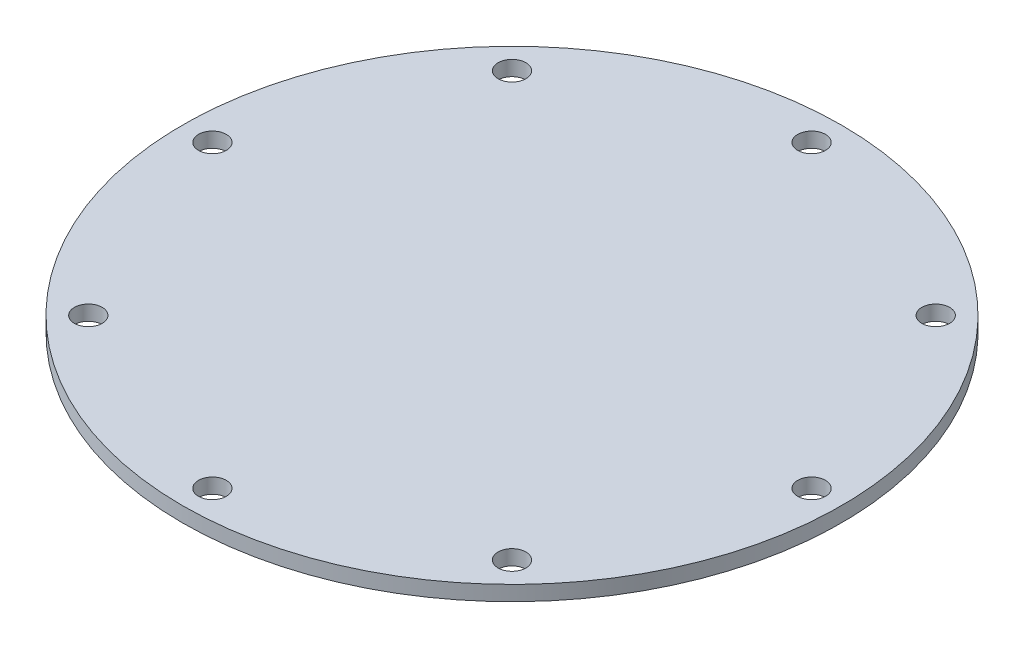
ISO-10303-21;
HEADER;
FILE_DESCRIPTION(('STEP AP214'),'2;1');
FILE_NAME('part.step','',(''),(''),'','','');
FILE_SCHEMA(('AUTOMOTIVE_DESIGN { 1 0 10303 214 1 1 1 1 }'));
ENDSEC;
DATA;
#1=APPLICATION_CONTEXT('core data for automotive mechanical design processes');
#2=APPLICATION_PROTOCOL_DEFINITION('international standard','automotive_design',2000,#1);
#3=PRODUCT_CONTEXT('',#1,'mechanical');
#4=PRODUCT('Part','Part','',(#3));
#5=PRODUCT_RELATED_PRODUCT_CATEGORY('part','',(#4));
#6=PRODUCT_DEFINITION_FORMATION('','',#4);
#7=PRODUCT_DEFINITION_CONTEXT('part definition',#1,'design');
#8=PRODUCT_DEFINITION('design','',#6,#7);
#9=PRODUCT_DEFINITION_SHAPE('','',#8);
#10=(LENGTH_UNIT() NAMED_UNIT(*) SI_UNIT(.MILLI.,.METRE.));
#11=(NAMED_UNIT(*) PLANE_ANGLE_UNIT() SI_UNIT($,.RADIAN.));
#12=(NAMED_UNIT(*) SI_UNIT($,.STERADIAN.) SOLID_ANGLE_UNIT());
#13=UNCERTAINTY_MEASURE_WITH_UNIT(LENGTH_MEASURE(1.E-05),#10,'distance_accuracy_value','');
#14=(GEOMETRIC_REPRESENTATION_CONTEXT(3) GLOBAL_UNCERTAINTY_ASSIGNED_CONTEXT((#13)) GLOBAL_UNIT_ASSIGNED_CONTEXT((#10,
#11,#12)) REPRESENTATION_CONTEXT('',''));
#15=CARTESIAN_POINT('',(0.,0.,0.));
#16=DIRECTION('',(0.,0.,1.));
#17=DIRECTION('',(1.,0.,0.));
#18=AXIS2_PLACEMENT_3D('',#15,#16,#17);
#19=CARTESIAN_POINT('',(-34.925,1.5875,0.));
#20=DIRECTION('',(0.,-1.,0.));
#21=DIRECTION('',(0.,0.,-1.));
#22=AXIS2_PLACEMENT_3D('',#19,#20,#21);
#23=PLANE('',#22);
#24=CARTESIAN_POINT('',(22.4506403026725,1.5875,22.4506403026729));
#25=DIRECTION('',(0.,1.,0.));
#26=DIRECTION('',(0.,0.,1.));
#27=AXIS2_PLACEMENT_3D('',#24,#25,#26);
#28=CIRCLE('',#27,1.47319999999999);
#29=CARTESIAN_POINT('',(22.4506403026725,1.5875,23.9238403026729));
#30=VERTEX_POINT('',#29);
#31=EDGE_CURVE('E112',#30,#30,#28,.T.);
#32=ORIENTED_EDGE('',*,*,#31,.F.);
#33=EDGE_LOOP('',(#32));
#34=FACE_BOUND('',#33,.T.);
#35=CARTESIAN_POINT('',(1.12573502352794E-13,1.5875,-31.7499999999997));
#36=DIRECTION('',(0.,1.,0.));
#37=DIRECTION('',(0.,0.,1.));
#38=AXIS2_PLACEMENT_3D('',#35,#36,#37);
#39=CIRCLE('',#38,1.47319999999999);
#40=CARTESIAN_POINT('',(1.12573502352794E-13,1.5875,-30.2767999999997));
#41=VERTEX_POINT('',#40);
#42=EDGE_CURVE('E89',#41,#41,#39,.T.);
#43=ORIENTED_EDGE('',*,*,#42,.F.);
#44=EDGE_LOOP('',(#43));
#45=FACE_BOUND('',#44,.T.);
#46=CARTESIAN_POINT('',(-22.4506403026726,1.5875,-22.4506403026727));
#47=DIRECTION('',(0.,1.,0.));
#48=DIRECTION('',(0.,0.,1.));
#49=AXIS2_PLACEMENT_3D('',#46,#47,#48);
#50=CIRCLE('',#49,1.47319999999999);
#51=CARTESIAN_POINT('',(-22.4506403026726,1.5875,-20.9774403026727));
#52=VERTEX_POINT('',#51);
#53=EDGE_CURVE('E81',#52,#52,#50,.T.);
#54=ORIENTED_EDGE('',*,*,#53,.F.);
#55=EDGE_LOOP('',(#54));
#56=FACE_BOUND('',#55,.T.);
#57=CARTESIAN_POINT('',(-31.7499999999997,1.5875,0.));
#58=DIRECTION('',(0.,1.,0.));
#59=DIRECTION('',(0.,0.,1.));
#60=AXIS2_PLACEMENT_3D('',#57,#58,#59);
#61=CIRCLE('',#60,1.47319999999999);
#62=CARTESIAN_POINT('',(-31.7499999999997,1.5875,1.47319999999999));
#63=VERTEX_POINT('',#62);
#64=EDGE_CURVE('E72',#63,#63,#61,.T.);
#65=ORIENTED_EDGE('',*,*,#64,.F.);
#66=EDGE_LOOP('',(#65));
#67=FACE_BOUND('',#66,.T.);
#68=CARTESIAN_POINT('',(0.,1.5875,0.));
#69=DIRECTION('',(0.,-1.,0.));
#70=DIRECTION('',(0.,0.,-1.));
#71=AXIS2_PLACEMENT_3D('',#68,#69,#70);
#72=CIRCLE('',#71,34.925);
#73=CARTESIAN_POINT('',(0.,1.5875,-34.925));
#74=VERTEX_POINT('',#73);
#75=EDGE_CURVE('E60',#74,#74,#72,.T.);
#76=ORIENTED_EDGE('',*,*,#75,.F.);
#77=EDGE_LOOP('',(#76));
#78=FACE_BOUND('',#77,.T.);
#79=CARTESIAN_POINT('',(22.4506403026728,1.5875,-22.4506403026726));
#80=DIRECTION('',(0.,1.,0.));
#81=DIRECTION('',(0.,0.,1.));
#82=AXIS2_PLACEMENT_3D('',#79,#80,#81);
#83=CIRCLE('',#82,1.47319999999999);
#84=CARTESIAN_POINT('',(22.4506403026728,1.5875,-20.9774403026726));
#85=VERTEX_POINT('',#84);
#86=EDGE_CURVE('E97',#85,#85,#83,.T.);
#87=ORIENTED_EDGE('',*,*,#86,.F.);
#88=EDGE_LOOP('',(#87));
#89=FACE_BOUND('',#88,.T.);
#90=CARTESIAN_POINT('',(31.7499999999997,1.5875,0.));
#91=DIRECTION('',(0.,1.,0.));
#92=DIRECTION('',(0.,0.,1.));
#93=AXIS2_PLACEMENT_3D('',#90,#91,#92);
#94=CIRCLE('',#93,1.47319999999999);
#95=CARTESIAN_POINT('',(31.7499999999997,1.5875,1.47319999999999));
#96=VERTEX_POINT('',#95);
#97=EDGE_CURVE('E104',#96,#96,#94,.T.);
#98=ORIENTED_EDGE('',*,*,#97,.F.);
#99=EDGE_LOOP('',(#98));
#100=FACE_BOUND('',#99,.T.);
#101=CARTESIAN_POINT('',(-3.34282567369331E-13,1.5875,31.7499999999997));
#102=DIRECTION('',(0.,1.,0.));
#103=DIRECTION('',(0.,0.,1.));
#104=AXIS2_PLACEMENT_3D('',#101,#102,#103);
#105=CIRCLE('',#104,1.47319999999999);
#106=CARTESIAN_POINT('',(-3.34282567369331E-13,1.5875,33.2231999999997));
#107=VERTEX_POINT('',#106);
#108=EDGE_CURVE('E120',#107,#107,#105,.T.);
#109=ORIENTED_EDGE('',*,*,#108,.F.);
#110=EDGE_LOOP('',(#109));
#111=FACE_BOUND('',#110,.T.);
#112=CARTESIAN_POINT('',(-22.450640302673,1.5875,22.4506403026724));
#113=DIRECTION('',(0.,1.,0.));
#114=DIRECTION('',(0.,0.,1.));
#115=AXIS2_PLACEMENT_3D('',#112,#113,#114);
#116=CIRCLE('',#115,1.47319999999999);
#117=CARTESIAN_POINT('',(-22.450640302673,1.5875,23.9238403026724));
#118=VERTEX_POINT('',#117);
#119=EDGE_CURVE('E128',#118,#118,#116,.T.);
#120=ORIENTED_EDGE('',*,*,#119,.F.);
#121=EDGE_LOOP('',(#120));
#122=FACE_BOUND('',#121,.T.);
#123=ADVANCED_FACE('F52',(#34,#45,#56,#67,#78,#89,#100,#111,#122),#23,.F.);
#124=CARTESIAN_POINT('',(0.,0.,0.));
#125=DIRECTION('',(0.,1.,0.));
#126=DIRECTION('',(0.,0.,1.));
#127=AXIS2_PLACEMENT_3D('',#124,#125,#126);
#128=PLANE('',#127);
#129=CARTESIAN_POINT('',(-22.450640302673,0.,22.4506403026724));
#130=DIRECTION('',(0.,1.,0.));
#131=DIRECTION('',(0.,0.,1.));
#132=AXIS2_PLACEMENT_3D('',#129,#130,#131);
#133=CIRCLE('',#132,1.4732);
#134=CARTESIAN_POINT('',(-22.450640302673,0.,23.9238403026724));
#135=VERTEX_POINT('',#134);
#136=EDGE_CURVE('E124',#135,#135,#133,.T.);
#137=ORIENTED_EDGE('',*,*,#136,.T.);
#138=EDGE_LOOP('',(#137));
#139=FACE_BOUND('',#138,.T.);
#140=CARTESIAN_POINT('',(-3.34282567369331E-13,0.,31.7499999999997));
#141=DIRECTION('',(0.,1.,0.));
#142=DIRECTION('',(0.,0.,1.));
#143=AXIS2_PLACEMENT_3D('',#140,#141,#142);
#144=CIRCLE('',#143,1.4732);
#145=CARTESIAN_POINT('',(-3.34282567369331E-13,0.,33.2231999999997));
#146=VERTEX_POINT('',#145);
#147=EDGE_CURVE('E116',#146,#146,#144,.T.);
#148=ORIENTED_EDGE('',*,*,#147,.T.);
#149=EDGE_LOOP('',(#148));
#150=FACE_BOUND('',#149,.T.);
#151=CARTESIAN_POINT('',(22.4506403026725,0.,22.4506403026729));
#152=DIRECTION('',(0.,1.,0.));
#153=DIRECTION('',(0.,0.,1.));
#154=AXIS2_PLACEMENT_3D('',#151,#152,#153);
#155=CIRCLE('',#154,1.4732);
#156=CARTESIAN_POINT('',(22.4506403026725,0.,23.9238403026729));
#157=VERTEX_POINT('',#156);
#158=EDGE_CURVE('E108',#157,#157,#155,.T.);
#159=ORIENTED_EDGE('',*,*,#158,.T.);
#160=EDGE_LOOP('',(#159));
#161=FACE_BOUND('',#160,.T.);
#162=CARTESIAN_POINT('',(31.7499999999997,0.,0.));
#163=DIRECTION('',(0.,1.,0.));
#164=DIRECTION('',(0.,0.,1.));
#165=AXIS2_PLACEMENT_3D('',#162,#163,#164);
#166=CIRCLE('',#165,1.4732);
#167=CARTESIAN_POINT('',(31.7499999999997,0.,1.4732));
#168=VERTEX_POINT('',#167);
#169=EDGE_CURVE('E100',#168,#168,#166,.T.);
#170=ORIENTED_EDGE('',*,*,#169,.T.);
#171=EDGE_LOOP('',(#170));
#172=FACE_BOUND('',#171,.T.);
#173=CARTESIAN_POINT('',(22.4506403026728,0.,-22.4506403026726));
#174=DIRECTION('',(0.,1.,0.));
#175=DIRECTION('',(0.,0.,1.));
#176=AXIS2_PLACEMENT_3D('',#173,#174,#175);
#177=CIRCLE('',#176,1.4732);
#178=CARTESIAN_POINT('',(22.4506403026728,0.,-20.9774403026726));
#179=VERTEX_POINT('',#178);
#180=EDGE_CURVE('E93',#179,#179,#177,.T.);
#181=ORIENTED_EDGE('',*,*,#180,.T.);
#182=EDGE_LOOP('',(#181));
#183=FACE_BOUND('',#182,.T.);
#184=CARTESIAN_POINT('',(1.12573502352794E-13,0.,-31.7499999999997));
#185=DIRECTION('',(0.,1.,0.));
#186=DIRECTION('',(0.,0.,1.));
#187=AXIS2_PLACEMENT_3D('',#184,#185,#186);
#188=CIRCLE('',#187,1.4732);
#189=CARTESIAN_POINT('',(1.12573502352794E-13,0.,-30.2767999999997));
#190=VERTEX_POINT('',#189);
#191=EDGE_CURVE('E85',#190,#190,#188,.T.);
#192=ORIENTED_EDGE('',*,*,#191,.T.);
#193=EDGE_LOOP('',(#192));
#194=FACE_BOUND('',#193,.T.);
#195=CARTESIAN_POINT('',(-22.4506403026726,0.,-22.4506403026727));
#196=DIRECTION('',(0.,1.,0.));
#197=DIRECTION('',(0.,0.,1.));
#198=AXIS2_PLACEMENT_3D('',#195,#196,#197);
#199=CIRCLE('',#198,1.4732);
#200=CARTESIAN_POINT('',(-22.4506403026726,0.,-20.9774403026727));
#201=VERTEX_POINT('',#200);
#202=EDGE_CURVE('E77',#201,#201,#199,.T.);
#203=ORIENTED_EDGE('',*,*,#202,.T.);
#204=EDGE_LOOP('',(#203));
#205=FACE_BOUND('',#204,.T.);
#206=CARTESIAN_POINT('',(-31.7499999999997,0.,0.));
#207=DIRECTION('',(0.,1.,0.));
#208=DIRECTION('',(0.,0.,1.));
#209=AXIS2_PLACEMENT_3D('',#206,#207,#208);
#210=CIRCLE('',#209,1.4732);
#211=CARTESIAN_POINT('',(-31.7499999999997,0.,1.4732));
#212=VERTEX_POINT('',#211);
#213=EDGE_CURVE('E66',#212,#212,#210,.T.);
#214=ORIENTED_EDGE('',*,*,#213,.T.);
#215=EDGE_LOOP('',(#214));
#216=FACE_BOUND('',#215,.T.);
#217=CARTESIAN_POINT('',(0.,0.,0.));
#218=DIRECTION('',(0.,-1.,0.));
#219=DIRECTION('',(0.,0.,-1.));
#220=AXIS2_PLACEMENT_3D('',#217,#218,#219);
#221=CIRCLE('',#220,34.925);
#222=CARTESIAN_POINT('',(0.,0.,-34.925));
#223=VERTEX_POINT('',#222);
#224=EDGE_CURVE('E12',#223,#223,#221,.T.);
#225=ORIENTED_EDGE('',*,*,#224,.T.);
#226=EDGE_LOOP('',(#225));
#227=FACE_BOUND('',#226,.T.);
#228=ADVANCED_FACE('F54',(#139,#150,#161,#172,#183,#194,#205,#216,#227),#128,.F.);
#229=CARTESIAN_POINT('',(0.,0.,0.));
#230=DIRECTION('',(0.,-1.,0.));
#231=DIRECTION('',(0.,0.,-1.));
#232=AXIS2_PLACEMENT_3D('',#229,#230,#231);
#233=CYLINDRICAL_SURFACE('',#232,34.925);
#234=ORIENTED_EDGE('',*,*,#224,.F.);
#235=EDGE_LOOP('',(#234));
#236=FACE_BOUND('',#235,.T.);
#237=ORIENTED_EDGE('',*,*,#75,.T.);
#238=EDGE_LOOP('',(#237));
#239=FACE_BOUND('',#238,.T.);
#240=ADVANCED_FACE('F140',(#236,#239),#233,.T.);
#241=CARTESIAN_POINT('',(-31.7499999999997,1.5875,0.));
#242=DIRECTION('',(0.,1.,0.));
#243=DIRECTION('',(0.,0.,1.));
#244=AXIS2_PLACEMENT_3D('',#241,#242,#243);
#245=CYLINDRICAL_SURFACE('',#244,1.47319999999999);
#246=ORIENTED_EDGE('',*,*,#213,.F.);
#247=EDGE_LOOP('',(#246));
#248=FACE_BOUND('',#247,.T.);
#249=ORIENTED_EDGE('',*,*,#64,.T.);
#250=EDGE_LOOP('',(#249));
#251=FACE_BOUND('',#250,.T.);
#252=ADVANCED_FACE('F145',(#248,#251),#245,.F.);
#253=CARTESIAN_POINT('',(-22.4506403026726,1.5875,-22.4506403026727));
#254=DIRECTION('',(0.,1.,0.));
#255=DIRECTION('',(0.,0.,1.));
#256=AXIS2_PLACEMENT_3D('',#253,#254,#255);
#257=CYLINDRICAL_SURFACE('',#256,1.47319999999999);
#258=ORIENTED_EDGE('',*,*,#202,.F.);
#259=EDGE_LOOP('',(#258));
#260=FACE_BOUND('',#259,.T.);
#261=ORIENTED_EDGE('',*,*,#53,.T.);
#262=EDGE_LOOP('',(#261));
#263=FACE_BOUND('',#262,.T.);
#264=ADVANCED_FACE('F153',(#260,#263),#257,.F.);
#265=CARTESIAN_POINT('',(1.12573502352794E-13,1.5875,-31.7499999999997));
#266=DIRECTION('',(0.,1.,0.));
#267=DIRECTION('',(0.,0.,1.));
#268=AXIS2_PLACEMENT_3D('',#265,#266,#267);
#269=CYLINDRICAL_SURFACE('',#268,1.47319999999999);
#270=ORIENTED_EDGE('',*,*,#191,.F.);
#271=EDGE_LOOP('',(#270));
#272=FACE_BOUND('',#271,.T.);
#273=ORIENTED_EDGE('',*,*,#42,.T.);
#274=EDGE_LOOP('',(#273));
#275=FACE_BOUND('',#274,.T.);
#276=ADVANCED_FACE('F158',(#272,#275),#269,.F.);
#277=CARTESIAN_POINT('',(22.4506403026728,1.5875,-22.4506403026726));
#278=DIRECTION('',(0.,1.,0.));
#279=DIRECTION('',(0.,0.,1.));
#280=AXIS2_PLACEMENT_3D('',#277,#278,#279);
#281=CYLINDRICAL_SURFACE('',#280,1.47319999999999);
#282=ORIENTED_EDGE('',*,*,#180,.F.);
#283=EDGE_LOOP('',(#282));
#284=FACE_BOUND('',#283,.T.);
#285=ORIENTED_EDGE('',*,*,#86,.T.);
#286=EDGE_LOOP('',(#285));
#287=FACE_BOUND('',#286,.T.);
#288=ADVANCED_FACE('F190',(#284,#287),#281,.F.);
#289=CARTESIAN_POINT('',(31.7499999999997,1.5875,0.));
#290=DIRECTION('',(0.,1.,0.));
#291=DIRECTION('',(0.,0.,1.));
#292=AXIS2_PLACEMENT_3D('',#289,#290,#291);
#293=CYLINDRICAL_SURFACE('',#292,1.47319999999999);
#294=ORIENTED_EDGE('',*,*,#169,.F.);
#295=EDGE_LOOP('',(#294));
#296=FACE_BOUND('',#295,.T.);
#297=ORIENTED_EDGE('',*,*,#97,.T.);
#298=EDGE_LOOP('',(#297));
#299=FACE_BOUND('',#298,.T.);
#300=ADVANCED_FACE('F183',(#296,#299),#293,.F.);
#301=CARTESIAN_POINT('',(22.4506403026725,1.5875,22.4506403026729));
#302=DIRECTION('',(0.,1.,0.));
#303=DIRECTION('',(0.,0.,1.));
#304=AXIS2_PLACEMENT_3D('',#301,#302,#303);
#305=CYLINDRICAL_SURFACE('',#304,1.47319999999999);
#306=ORIENTED_EDGE('',*,*,#158,.F.);
#307=EDGE_LOOP('',(#306));
#308=FACE_BOUND('',#307,.T.);
#309=ORIENTED_EDGE('',*,*,#31,.T.);
#310=EDGE_LOOP('',(#309));
#311=FACE_BOUND('',#310,.T.);
#312=ADVANCED_FACE('F174',(#308,#311),#305,.F.);
#313=CARTESIAN_POINT('',(-3.34282567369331E-13,1.5875,31.7499999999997));
#314=DIRECTION('',(0.,1.,0.));
#315=DIRECTION('',(0.,0.,1.));
#316=AXIS2_PLACEMENT_3D('',#313,#314,#315);
#317=CYLINDRICAL_SURFACE('',#316,1.47319999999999);
#318=ORIENTED_EDGE('',*,*,#147,.F.);
#319=EDGE_LOOP('',(#318));
#320=FACE_BOUND('',#319,.T.);
#321=ORIENTED_EDGE('',*,*,#108,.T.);
#322=EDGE_LOOP('',(#321));
#323=FACE_BOUND('',#322,.T.);
#324=ADVANCED_FACE('F172',(#320,#323),#317,.F.);
#325=CARTESIAN_POINT('',(-22.450640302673,1.5875,22.4506403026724));
#326=DIRECTION('',(0.,1.,0.));
#327=DIRECTION('',(0.,0.,1.));
#328=AXIS2_PLACEMENT_3D('',#325,#326,#327);
#329=CYLINDRICAL_SURFACE('',#328,1.47319999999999);
#330=ORIENTED_EDGE('',*,*,#136,.F.);
#331=EDGE_LOOP('',(#330));
#332=FACE_BOUND('',#331,.T.);
#333=ORIENTED_EDGE('',*,*,#119,.T.);
#334=EDGE_LOOP('',(#333));
#335=FACE_BOUND('',#334,.T.);
#336=ADVANCED_FACE('F133',(#332,#335),#329,.F.);
#337=CLOSED_SHELL('',(#123,#228,#240,#252,#264,#276,#288,#300,#312,#324,#336));
#338=MANIFOLD_SOLID_BREP('B2',#337);
#339=ADVANCED_BREP_SHAPE_REPRESENTATION('',(#18,#338),#14);
#340=SHAPE_DEFINITION_REPRESENTATION(#9,#339);
ENDSEC;
END-ISO-10303-21;
